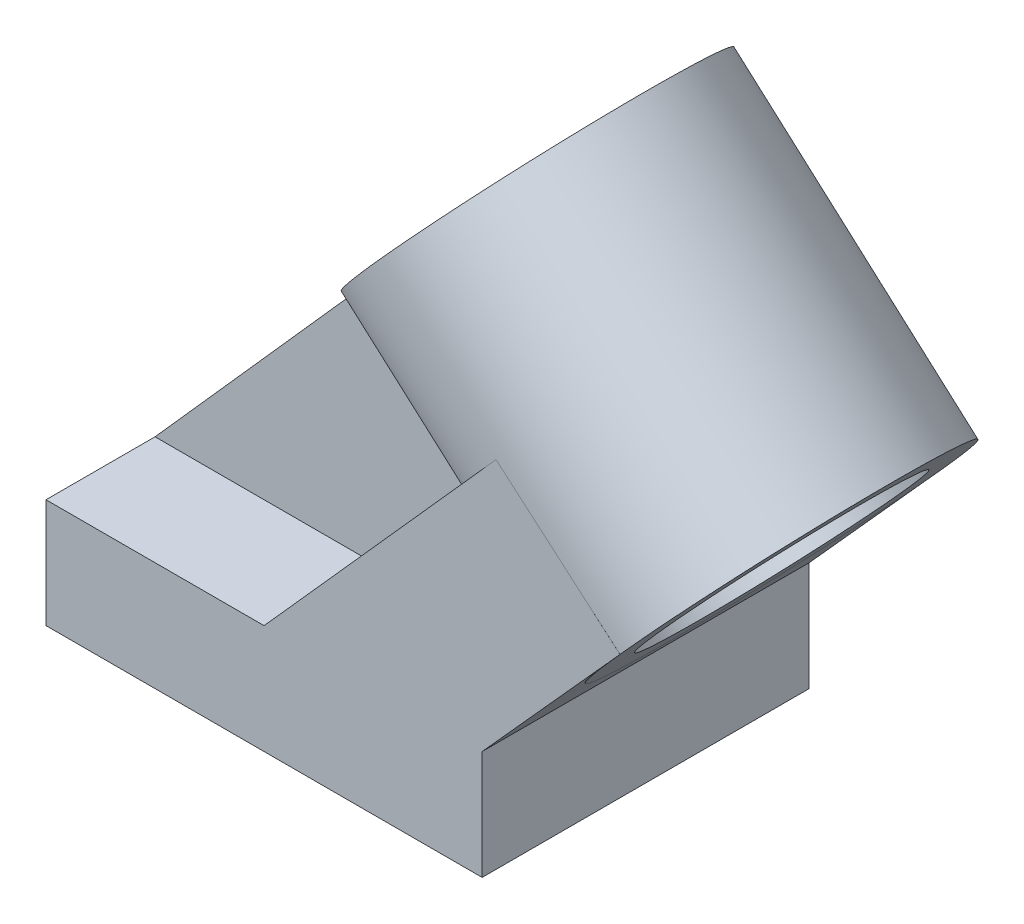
from build123d import *

# Parameters (mm, degrees)
SKETCH2_W                = 101.6
SKETCH2_H                = 25.4
BOSS_EXTRUDE1_DEPTH      = 76.2
BOSS_EXTRUDE2_DEPTH      = 76.2
BOSS_EXTRUDE3_DEPTH      = 38.1
BOSS_EXTRUDE3_DEPTH_BACK = 38.1
SKETCH5_R                = 38.1
SKETCH5_R_2              = 28.575
SKETCH6_R                = 28.575
CUT_EXTRUDE1_DEPTH       = 38.1
RIB1_REACH               = 163.708
SKETCH7_WALL_W           = 402.289787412
SKETCH7_WALL_H           = 25.4


with BuildPart() as part:
    # Sketch2 → Boss-Extrude1 (new body)
    with BuildSketch(Plane.XY):
        with Locations((0, -12.7)):
            Rectangle(SKETCH2_W, SKETCH2_H)
    extrude(amount=BOSS_EXTRUDE1_DEPTH)

    # Sketch4 → Boss-Extrude2 (add)
    with BuildSketch(Plane.XY.offset(76.2)):
        Polygon((50.8, 0), (82.905263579, 35.656507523), (54.040747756, 60.52515699), (0, 0), align=None)
    extrude(amount=-BOSS_EXTRUDE2_DEPTH)

    # Sketch5 → Boss-Extrude3 (add, two sides: drawn at the far end of the back side and taken through both)
    with BuildSketch(Plane(origin=(0, 0, 0), x_dir=(0, 0, 1), z_dir=(-0.7459350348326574, 0.6660187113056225, 0)).offset(-BOSS_EXTRUDE3_DEPTH_BACK)):
        with Locations(Location((38.1, 81.139984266, 0), (0, 0, 270))):
            Circle(SKETCH5_R)
        with Locations(Location((38.1, 81.139984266, 0), (0, 0, 270))):
            Circle(SKETCH5_R_2, mode=Mode.SUBTRACT)
    extrude(amount=BOSS_EXTRUDE3_DEPTH + BOSS_EXTRUDE3_DEPTH_BACK)

    # Sketch6 → Cut-Extrude1 (cut)
    with BuildSketch(Plane(origin=(0, 0, 0), x_dir=(0, 0, 1), z_dir=(-0.7459350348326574, 0.6660187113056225, 0))):
        with Locations(Location((38.1, 81.139984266, 0), (0, 0, 270))):
            Circle(SKETCH6_R)
    extrude(amount=-CUT_EXTRUDE1_DEPTH, mode=Mode.SUBTRACT)

    # Sketch7 wall → Rib1 (add, up to next)
    with BuildSketch(Plane(origin=(-25.267871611, 28.731714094, 38.1), x_dir=(0.66425958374, 0.74750197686, 0), z_dir=(-0.74750197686, 0.66425958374, 0)), mode=Mode.PRIVATE) as rib1_sk1:
        Rectangle(SKETCH7_WALL_W, SKETCH7_WALL_H)
    rib1_tool1 = extrude(rib1_sk1.sketch, amount=-RIB1_REACH, mode=Mode.PRIVATE) - part.part
    add(rib1_tool1.solids().sort_by_distance((-25.267871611, 28.731714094, 38.1))[0])


solid = part.part
